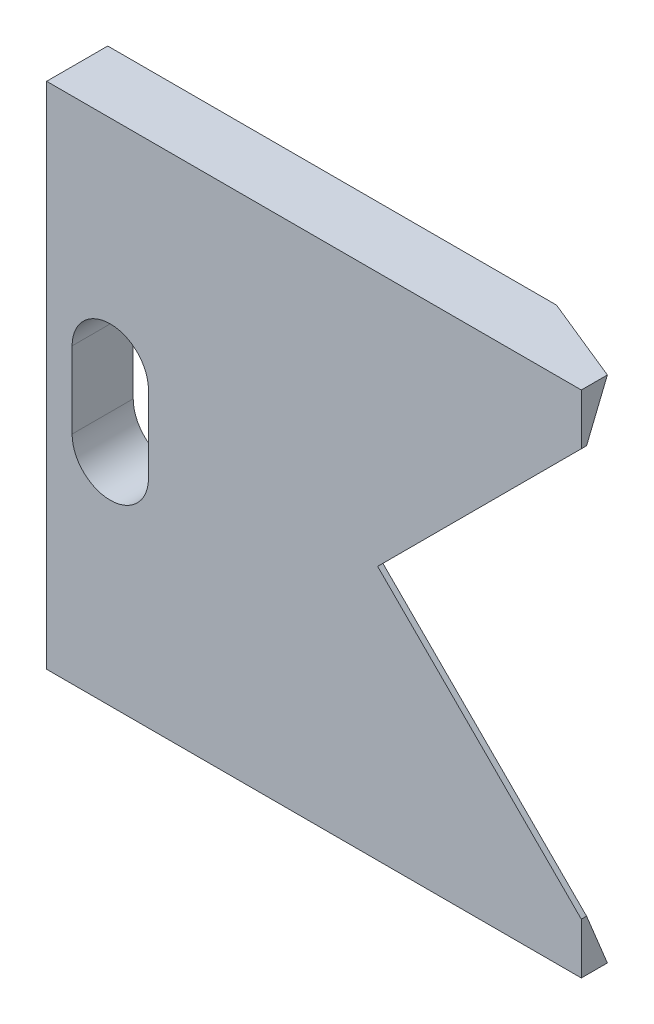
ISO-10303-21;
HEADER;
FILE_DESCRIPTION(('STEP AP214'),'2;1');
FILE_NAME('part.step','',(''),(''),'','','');
FILE_SCHEMA(('AUTOMOTIVE_DESIGN { 1 0 10303 214 1 1 1 1 }'));
ENDSEC;
DATA;
#1=APPLICATION_CONTEXT('core data for automotive mechanical design processes');
#2=APPLICATION_PROTOCOL_DEFINITION('international standard','automotive_design',2000,#1);
#3=PRODUCT_CONTEXT('',#1,'mechanical');
#4=PRODUCT('Part','Part','',(#3));
#5=PRODUCT_RELATED_PRODUCT_CATEGORY('part','',(#4));
#6=PRODUCT_DEFINITION_FORMATION('','',#4);
#7=PRODUCT_DEFINITION_CONTEXT('part definition',#1,'design');
#8=PRODUCT_DEFINITION('design','',#6,#7);
#9=PRODUCT_DEFINITION_SHAPE('','',#8);
#10=(LENGTH_UNIT() NAMED_UNIT(*) SI_UNIT(.MILLI.,.METRE.));
#11=(NAMED_UNIT(*) PLANE_ANGLE_UNIT() SI_UNIT($,.RADIAN.));
#12=(NAMED_UNIT(*) SI_UNIT($,.STERADIAN.) SOLID_ANGLE_UNIT());
#13=UNCERTAINTY_MEASURE_WITH_UNIT(LENGTH_MEASURE(1.E-05),#10,'distance_accuracy_value','');
#14=(GEOMETRIC_REPRESENTATION_CONTEXT(3) GLOBAL_UNCERTAINTY_ASSIGNED_CONTEXT((#13)) GLOBAL_UNIT_ASSIGNED_CONTEXT((#10,
#11,#12)) REPRESENTATION_CONTEXT('',''));
#15=CARTESIAN_POINT('',(0.,0.,0.));
#16=DIRECTION('',(0.,0.,1.));
#17=DIRECTION('',(1.,0.,0.));
#18=AXIS2_PLACEMENT_3D('',#15,#16,#17);
#19=CARTESIAN_POINT('',(0.,9.99999999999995,2.4));
#20=DIRECTION('',(0.,0.,1.));
#21=DIRECTION('',(1.,0.,0.));
#22=AXIS2_PLACEMENT_3D('',#19,#20,#21);
#23=PLANE('',#22);
#24=DIRECTION('',(0.,-1.,0.));
#25=VECTOR('',#24,1.);
#26=CARTESIAN_POINT('',(21.,8.00000000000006,2.4));
#27=LINE('',#26,#25);
#28=CARTESIAN_POINT('',(21.,9.99999999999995,2.4));
#29=VERTEX_POINT('',#28);
#30=CARTESIAN_POINT('',(21.,8.00000000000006,2.4));
#31=VERTEX_POINT('',#30);
#32=EDGE_CURVE('E122',#29,#31,#27,.T.);
#33=ORIENTED_EDGE('',*,*,#32,.F.);
#34=DIRECTION('',(-1.,0.,0.));
#35=VECTOR('',#34,1.);
#36=CARTESIAN_POINT('',(0.,9.99999999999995,2.4));
#37=LINE('',#36,#35);
#38=CARTESIAN_POINT('',(0.,9.99999999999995,2.4));
#39=VERTEX_POINT('',#38);
#40=EDGE_CURVE('E130',#29,#39,#37,.T.);
#41=ORIENTED_EDGE('',*,*,#40,.T.);
#42=DIRECTION('',(0.,-1.,0.));
#43=VECTOR('',#42,1.);
#44=CARTESIAN_POINT('',(0.,-9.99999999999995,2.4));
#45=LINE('',#44,#43);
#46=CARTESIAN_POINT('',(0.,-9.99999999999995,2.4));
#47=VERTEX_POINT('',#46);
#48=EDGE_CURVE('E138',#39,#47,#45,.T.);
#49=ORIENTED_EDGE('',*,*,#48,.T.);
#50=DIRECTION('',(1.,0.,0.));
#51=VECTOR('',#50,1.);
#52=CARTESIAN_POINT('',(0.,-9.99999999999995,2.4));
#53=LINE('',#52,#51);
#54=CARTESIAN_POINT('',(21.,-9.99999999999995,2.4));
#55=VERTEX_POINT('',#54);
#56=EDGE_CURVE('E141',#47,#55,#53,.T.);
#57=ORIENTED_EDGE('',*,*,#56,.T.);
#58=DIRECTION('',(0.,-1.,0.));
#59=VECTOR('',#58,1.);
#60=CARTESIAN_POINT('',(21.,-9.99999999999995,2.4));
#61=LINE('',#60,#59);
#62=CARTESIAN_POINT('',(21.,-8.00000000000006,2.4));
#63=VERTEX_POINT('',#62);
#64=EDGE_CURVE('E184',#63,#55,#61,.T.);
#65=ORIENTED_EDGE('',*,*,#64,.F.);
#66=DIRECTION('',(-0.707106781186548,0.707106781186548,0.));
#67=VECTOR('',#66,1.);
#68=CARTESIAN_POINT('',(22.9999999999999,-9.99999999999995,2.4));
#69=LINE('',#68,#67);
#70=CARTESIAN_POINT('',(12.9999999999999,0.,2.4));
#71=VERTEX_POINT('',#70);
#72=EDGE_CURVE('E150',#63,#71,#69,.T.);
#73=ORIENTED_EDGE('',*,*,#72,.T.);
#74=DIRECTION('',(0.707106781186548,0.707106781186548,0.));
#75=VECTOR('',#74,1.);
#76=CARTESIAN_POINT('',(22.9999999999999,9.99999999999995,2.4));
#77=LINE('',#76,#75);
#78=EDGE_CURVE('E133',#71,#31,#77,.T.);
#79=ORIENTED_EDGE('',*,*,#78,.T.);
#80=EDGE_LOOP('',(#33,#41,#49,#57,#65,#73,#79));
#81=FACE_BOUND('',#80,.T.);
#82=DIRECTION('',(0.,1.,0.));
#83=VECTOR('',#82,1.);
#84=CARTESIAN_POINT('',(4.,1.5,2.4));
#85=LINE('',#84,#83);
#86=CARTESIAN_POINT('',(4.,-1.5,2.4));
#87=VERTEX_POINT('',#86);
#88=CARTESIAN_POINT('',(4.,1.5,2.4));
#89=VERTEX_POINT('',#88);
#90=EDGE_CURVE('E216',#87,#89,#85,.T.);
#91=ORIENTED_EDGE('',*,*,#90,.F.);
#92=CARTESIAN_POINT('',(2.5,-1.5,2.4));
#93=DIRECTION('',(0.,0.,1.));
#94=DIRECTION('',(1.,0.,0.));
#95=AXIS2_PLACEMENT_3D('',#92,#93,#94);
#96=CIRCLE('',#95,1.5);
#97=CARTESIAN_POINT('',(1.,-1.5,2.4));
#98=VERTEX_POINT('',#97);
#99=EDGE_CURVE('E214',#98,#87,#96,.T.);
#100=ORIENTED_EDGE('',*,*,#99,.F.);
#101=DIRECTION('',(0.,-1.,0.));
#102=VECTOR('',#101,1.);
#103=CARTESIAN_POINT('',(1.,1.5,2.4));
#104=LINE('',#103,#102);
#105=CARTESIAN_POINT('',(1.,1.5,2.4));
#106=VERTEX_POINT('',#105);
#107=EDGE_CURVE('E221',#106,#98,#104,.T.);
#108=ORIENTED_EDGE('',*,*,#107,.F.);
#109=CARTESIAN_POINT('',(2.5,1.5,2.4));
#110=DIRECTION('',(0.,0.,1.));
#111=DIRECTION('',(1.,0.,0.));
#112=AXIS2_PLACEMENT_3D('',#109,#110,#111);
#113=CIRCLE('',#112,1.5);
#114=EDGE_CURVE('E218',#89,#106,#113,.T.);
#115=ORIENTED_EDGE('',*,*,#114,.F.);
#116=EDGE_LOOP('',(#91,#100,#108,#115));
#117=FACE_BOUND('',#116,.T.);
#118=ADVANCED_FACE('F29',(#81,#117),#23,.T.);
#119=CARTESIAN_POINT('',(0.,9.99999999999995,0.));
#120=DIRECTION('',(0.,0.,1.));
#121=DIRECTION('',(1.,0.,0.));
#122=AXIS2_PLACEMENT_3D('',#119,#120,#121);
#123=PLANE('',#122);
#124=DIRECTION('',(-1.,0.,0.));
#125=VECTOR('',#124,1.);
#126=CARTESIAN_POINT('',(0.,9.99999999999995,0.));
#127=LINE('',#126,#125);
#128=CARTESIAN_POINT('',(17.6259884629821,9.99999999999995,0.));
#129=VERTEX_POINT('',#128);
#130=CARTESIAN_POINT('',(0.,9.99999999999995,0.));
#131=VERTEX_POINT('',#130);
#132=EDGE_CURVE('E233',#129,#131,#127,.T.);
#133=ORIENTED_EDGE('',*,*,#132,.F.);
#134=DIRECTION('',(-0.707106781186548,-0.707106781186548,0.));
#135=VECTOR('',#134,1.);
#136=CARTESIAN_POINT('',(8.81299423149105,1.1870057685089,0.));
#137=LINE('',#136,#135);
#138=CARTESIAN_POINT('',(7.62598846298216,0.,0.));
#139=VERTEX_POINT('',#138);
#140=EDGE_CURVE('E167',#129,#139,#137,.T.);
#141=ORIENTED_EDGE('',*,*,#140,.T.);
#142=DIRECTION('',(0.707106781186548,-0.707106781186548,0.));
#143=VECTOR('',#142,1.);
#144=CARTESIAN_POINT('',(-1.1870057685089,8.81299423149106,0.));
#145=LINE('',#144,#143);
#146=CARTESIAN_POINT('',(17.6259884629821,-9.99999999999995,0.));
#147=VERTEX_POINT('',#146);
#148=EDGE_CURVE('E165',#139,#147,#145,.T.);
#149=ORIENTED_EDGE('',*,*,#148,.T.);
#150=DIRECTION('',(1.,0.,0.));
#151=VECTOR('',#150,1.);
#152=CARTESIAN_POINT('',(0.,-9.99999999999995,0.));
#153=LINE('',#152,#151);
#154=CARTESIAN_POINT('',(0.,-9.99999999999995,0.));
#155=VERTEX_POINT('',#154);
#156=EDGE_CURVE('E139',#155,#147,#153,.T.);
#157=ORIENTED_EDGE('',*,*,#156,.F.);
#158=DIRECTION('',(0.,-1.,0.));
#159=VECTOR('',#158,1.);
#160=CARTESIAN_POINT('',(0.,-9.99999999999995,0.));
#161=LINE('',#160,#159);
#162=EDGE_CURVE('E144',#131,#155,#161,.T.);
#163=ORIENTED_EDGE('',*,*,#162,.F.);
#164=EDGE_LOOP('',(#133,#141,#149,#157,#163));
#165=FACE_BOUND('',#164,.T.);
#166=CARTESIAN_POINT('',(2.5,-1.5,0.));
#167=DIRECTION('',(0.,0.,1.));
#168=DIRECTION('',(1.,0.,0.));
#169=AXIS2_PLACEMENT_3D('',#166,#167,#168);
#170=CIRCLE('',#169,1.5);
#171=CARTESIAN_POINT('',(1.,-1.5,0.));
#172=VERTEX_POINT('',#171);
#173=CARTESIAN_POINT('',(4.,-1.5,0.));
#174=VERTEX_POINT('',#173);
#175=EDGE_CURVE('E194',#172,#174,#170,.T.);
#176=ORIENTED_EDGE('',*,*,#175,.T.);
#177=DIRECTION('',(0.,1.,0.));
#178=VECTOR('',#177,1.);
#179=CARTESIAN_POINT('',(4.,1.5,0.));
#180=LINE('',#179,#178);
#181=CARTESIAN_POINT('',(4.,1.5,0.));
#182=VERTEX_POINT('',#181);
#183=EDGE_CURVE('E205',#174,#182,#180,.T.);
#184=ORIENTED_EDGE('',*,*,#183,.T.);
#185=CARTESIAN_POINT('',(2.5,1.5,0.));
#186=DIRECTION('',(0.,0.,1.));
#187=DIRECTION('',(1.,0.,0.));
#188=AXIS2_PLACEMENT_3D('',#185,#186,#187);
#189=CIRCLE('',#188,1.5);
#190=CARTESIAN_POINT('',(1.,1.5,0.));
#191=VERTEX_POINT('',#190);
#192=EDGE_CURVE('E208',#182,#191,#189,.T.);
#193=ORIENTED_EDGE('',*,*,#192,.T.);
#194=DIRECTION('',(0.,-1.,0.));
#195=VECTOR('',#194,1.);
#196=CARTESIAN_POINT('',(1.,1.5,0.));
#197=LINE('',#196,#195);
#198=EDGE_CURVE('E211',#191,#172,#197,.T.);
#199=ORIENTED_EDGE('',*,*,#198,.T.);
#200=EDGE_LOOP('',(#176,#184,#193,#199));
#201=FACE_BOUND('',#200,.T.);
#202=ADVANCED_FACE('F244',(#165,#201),#123,.F.);
#203=CARTESIAN_POINT('',(0.,9.99999999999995,2.4));
#204=DIRECTION('',(0.,-1.,0.));
#205=DIRECTION('',(0.,0.,-1.));
#206=AXIS2_PLACEMENT_3D('',#203,#204,#205);
#207=PLANE('',#206);
#208=ORIENTED_EDGE('',*,*,#40,.F.);
#209=DIRECTION('',(0.,0.,1.));
#210=VECTOR('',#209,1.);
#211=CARTESIAN_POINT('',(21.,9.99999999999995,0.));
#212=LINE('',#211,#210);
#213=CARTESIAN_POINT('',(21.,9.99999999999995,1.37743444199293));
#214=VERTEX_POINT('',#213);
#215=EDGE_CURVE('E119',#214,#29,#212,.T.);
#216=ORIENTED_EDGE('',*,*,#215,.F.);
#217=DIRECTION('',(0.92582009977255,0.,0.377964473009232));
#218=VECTOR('',#217,1.);
#219=CARTESIAN_POINT('',(22.9999999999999,9.99999999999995,2.19393102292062));
#220=LINE('',#219,#218);
#221=EDGE_CURVE('E163',#214,#129,#220,.F.);
#222=ORIENTED_EDGE('',*,*,#221,.T.);
#223=ORIENTED_EDGE('',*,*,#132,.T.);
#224=DIRECTION('',(0.,0.,-1.));
#225=VECTOR('',#224,1.);
#226=CARTESIAN_POINT('',(0.,9.99999999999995,2.4));
#227=LINE('',#226,#225);
#228=EDGE_CURVE('E137',#39,#131,#227,.T.);
#229=ORIENTED_EDGE('',*,*,#228,.F.);
#230=EDGE_LOOP('',(#208,#216,#222,#223,#229));
#231=FACE_BOUND('',#230,.T.);
#232=ADVANCED_FACE('F31',(#231),#207,.F.);
#233=CARTESIAN_POINT('',(0.,-9.99999999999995,2.4));
#234=DIRECTION('',(1.,0.,0.));
#235=DIRECTION('',(0.,0.,-1.));
#236=AXIS2_PLACEMENT_3D('',#233,#234,#235);
#237=PLANE('',#236);
#238=ORIENTED_EDGE('',*,*,#162,.T.);
#239=DIRECTION('',(0.,0.,-1.));
#240=VECTOR('',#239,1.);
#241=CARTESIAN_POINT('',(0.,-9.99999999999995,2.4));
#242=LINE('',#241,#240);
#243=EDGE_CURVE('E156',#47,#155,#242,.T.);
#244=ORIENTED_EDGE('',*,*,#243,.F.);
#245=ORIENTED_EDGE('',*,*,#48,.F.);
#246=ORIENTED_EDGE('',*,*,#228,.T.);
#247=EDGE_LOOP('',(#238,#244,#245,#246));
#248=FACE_BOUND('',#247,.T.);
#249=ADVANCED_FACE('F237',(#248),#237,.F.);
#250=CARTESIAN_POINT('',(0.,-9.99999999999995,2.4));
#251=DIRECTION('',(0.,1.,0.));
#252=DIRECTION('',(0.,0.,1.));
#253=AXIS2_PLACEMENT_3D('',#250,#251,#252);
#254=PLANE('',#253);
#255=DIRECTION('',(-0.925820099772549,0.,-0.377964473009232));
#256=VECTOR('',#255,1.);
#257=CARTESIAN_POINT('',(22.9999999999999,-9.99999999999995,2.19393102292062));
#258=LINE('',#257,#256);
#259=CARTESIAN_POINT('',(21.,-9.99999999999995,1.37743444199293));
#260=VERTEX_POINT('',#259);
#261=EDGE_CURVE('E171',#147,#260,#258,.F.);
#262=ORIENTED_EDGE('',*,*,#261,.T.);
#263=DIRECTION('',(0.,0.,1.));
#264=VECTOR('',#263,1.);
#265=CARTESIAN_POINT('',(21.,-9.99999999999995,0.));
#266=LINE('',#265,#264);
#267=EDGE_CURVE('E51',#260,#55,#266,.T.);
#268=ORIENTED_EDGE('',*,*,#267,.T.);
#269=ORIENTED_EDGE('',*,*,#56,.F.);
#270=ORIENTED_EDGE('',*,*,#243,.T.);
#271=ORIENTED_EDGE('',*,*,#156,.T.);
#272=EDGE_LOOP('',(#262,#268,#269,#270,#271));
#273=FACE_BOUND('',#272,.T.);
#274=ADVANCED_FACE('F243',(#273),#254,.F.);
#275=CARTESIAN_POINT('',(22.9999999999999,-9.99999999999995,2.4));
#276=DIRECTION('',(-0.707106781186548,-0.707106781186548,0.));
#277=DIRECTION('',(0.707106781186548,-0.707106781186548,0.));
#278=AXIS2_PLACEMENT_3D('',#275,#276,#277);
#279=PLANE('',#278);
#280=ORIENTED_EDGE('',*,*,#72,.F.);
#281=DIRECTION('',(0.,0.,1.));
#282=VECTOR('',#281,1.);
#283=CARTESIAN_POINT('',(21.,-8.00000000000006,0.));
#284=LINE('',#283,#282);
#285=CARTESIAN_POINT('',(21.,-8.00000000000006,2.19393102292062));
#286=VERTEX_POINT('',#285);
#287=EDGE_CURVE('E175',#286,#63,#284,.T.);
#288=ORIENTED_EDGE('',*,*,#287,.F.);
#289=DIRECTION('',(-0.707106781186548,0.707106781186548,0.));
#290=VECTOR('',#289,1.);
#291=CARTESIAN_POINT('',(22.9999999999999,-9.99999999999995,2.19393102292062));
#292=LINE('',#291,#290);
#293=CARTESIAN_POINT('',(12.9999999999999,0.,2.19393102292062));
#294=VERTEX_POINT('',#293);
#295=EDGE_CURVE('E169',#286,#294,#292,.T.);
#296=ORIENTED_EDGE('',*,*,#295,.T.);
#297=DIRECTION('',(0.,0.,-1.));
#298=VECTOR('',#297,1.);
#299=CARTESIAN_POINT('',(12.9999999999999,0.,2.4));
#300=LINE('',#299,#298);
#301=EDGE_CURVE('E153',#71,#294,#300,.T.);
#302=ORIENTED_EDGE('',*,*,#301,.F.);
#303=EDGE_LOOP('',(#280,#288,#296,#302));
#304=FACE_BOUND('',#303,.T.);
#305=ADVANCED_FACE('F182',(#304),#279,.F.);
#306=CARTESIAN_POINT('',(22.9999999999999,9.99999999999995,2.4));
#307=DIRECTION('',(-0.707106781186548,0.707106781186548,0.));
#308=DIRECTION('',(-0.707106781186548,-0.707106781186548,0.));
#309=AXIS2_PLACEMENT_3D('',#306,#307,#308);
#310=PLANE('',#309);
#311=DIRECTION('',(0.707106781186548,0.707106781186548,0.));
#312=VECTOR('',#311,1.);
#313=CARTESIAN_POINT('',(22.9999999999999,9.99999999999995,2.19393102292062));
#314=LINE('',#313,#312);
#315=CARTESIAN_POINT('',(21.,8.00000000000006,2.19393102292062));
#316=VERTEX_POINT('',#315);
#317=EDGE_CURVE('E160',#294,#316,#314,.T.);
#318=ORIENTED_EDGE('',*,*,#317,.T.);
#319=DIRECTION('',(0.,0.,1.));
#320=VECTOR('',#319,1.);
#321=CARTESIAN_POINT('',(21.,8.00000000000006,0.));
#322=LINE('',#321,#320);
#323=EDGE_CURVE('E43',#316,#31,#322,.T.);
#324=ORIENTED_EDGE('',*,*,#323,.T.);
#325=ORIENTED_EDGE('',*,*,#78,.F.);
#326=ORIENTED_EDGE('',*,*,#301,.T.);
#327=EDGE_LOOP('',(#318,#324,#325,#326));
#328=FACE_BOUND('',#327,.T.);
#329=ADVANCED_FACE('F198',(#328),#310,.F.);
#330=CARTESIAN_POINT('',(2.5,-1.5,2.4));
#331=DIRECTION('',(0.,0.,-1.));
#332=DIRECTION('',(-1.,0.,0.));
#333=AXIS2_PLACEMENT_3D('',#330,#331,#332);
#334=CYLINDRICAL_SURFACE('',#333,1.5);
#335=ORIENTED_EDGE('',*,*,#175,.F.);
#336=DIRECTION('',(0.,0.,-1.));
#337=VECTOR('',#336,1.);
#338=CARTESIAN_POINT('',(1.,-1.5,2.4));
#339=LINE('',#338,#337);
#340=EDGE_CURVE('E223',#98,#172,#339,.T.);
#341=ORIENTED_EDGE('',*,*,#340,.F.);
#342=ORIENTED_EDGE('',*,*,#99,.T.);
#343=DIRECTION('',(0.,0.,-1.));
#344=VECTOR('',#343,1.);
#345=CARTESIAN_POINT('',(4.,-1.5,2.4));
#346=LINE('',#345,#344);
#347=EDGE_CURVE('E230',#87,#174,#346,.T.);
#348=ORIENTED_EDGE('',*,*,#347,.T.);
#349=EDGE_LOOP('',(#335,#341,#342,#348));
#350=FACE_BOUND('',#349,.T.);
#351=ADVANCED_FACE('F251',(#350),#334,.F.);
#352=CARTESIAN_POINT('',(4.,1.5,2.4));
#353=DIRECTION('',(-1.,0.,0.));
#354=DIRECTION('',(0.,-1.,0.));
#355=AXIS2_PLACEMENT_3D('',#352,#353,#354);
#356=PLANE('',#355);
#357=ORIENTED_EDGE('',*,*,#183,.F.);
#358=ORIENTED_EDGE('',*,*,#347,.F.);
#359=ORIENTED_EDGE('',*,*,#90,.T.);
#360=DIRECTION('',(0.,0.,-1.));
#361=VECTOR('',#360,1.);
#362=CARTESIAN_POINT('',(4.,1.5,2.4));
#363=LINE('',#362,#361);
#364=EDGE_CURVE('E228',#89,#182,#363,.T.);
#365=ORIENTED_EDGE('',*,*,#364,.T.);
#366=EDGE_LOOP('',(#357,#358,#359,#365));
#367=FACE_BOUND('',#366,.T.);
#368=ADVANCED_FACE('F260',(#367),#356,.T.);
#369=CARTESIAN_POINT('',(2.5,1.5,2.4));
#370=DIRECTION('',(0.,0.,-1.));
#371=DIRECTION('',(-1.,0.,0.));
#372=AXIS2_PLACEMENT_3D('',#369,#370,#371);
#373=CYLINDRICAL_SURFACE('',#372,1.5);
#374=ORIENTED_EDGE('',*,*,#192,.F.);
#375=ORIENTED_EDGE('',*,*,#364,.F.);
#376=ORIENTED_EDGE('',*,*,#114,.T.);
#377=DIRECTION('',(0.,0.,-1.));
#378=VECTOR('',#377,1.);
#379=CARTESIAN_POINT('',(1.,1.5,2.4));
#380=LINE('',#379,#378);
#381=EDGE_CURVE('E226',#106,#191,#380,.T.);
#382=ORIENTED_EDGE('',*,*,#381,.T.);
#383=EDGE_LOOP('',(#374,#375,#376,#382));
#384=FACE_BOUND('',#383,.T.);
#385=ADVANCED_FACE('F264',(#384),#373,.F.);
#386=CARTESIAN_POINT('',(1.,1.5,2.4));
#387=DIRECTION('',(1.,0.,0.));
#388=DIRECTION('',(0.,1.,0.));
#389=AXIS2_PLACEMENT_3D('',#386,#387,#388);
#390=PLANE('',#389);
#391=ORIENTED_EDGE('',*,*,#198,.F.);
#392=ORIENTED_EDGE('',*,*,#381,.F.);
#393=ORIENTED_EDGE('',*,*,#107,.T.);
#394=ORIENTED_EDGE('',*,*,#340,.T.);
#395=EDGE_LOOP('',(#391,#392,#393,#394));
#396=FACE_BOUND('',#395,.T.);
#397=ADVANCED_FACE('F255',(#396),#390,.T.);
#398=CARTESIAN_POINT('',(22.9999999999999,-9.99999999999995,2.19393102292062));
#399=DIRECTION('',(-0.353553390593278,-0.353553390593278,0.866025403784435));
#400=DIRECTION('',(0.925820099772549,0.,0.377964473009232));
#401=AXIS2_PLACEMENT_3D('',#398,#399,#400);
#402=PLANE('',#401);
#403=DIRECTION('',(0.,-0.925820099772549,-0.377964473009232));
#404=VECTOR('',#403,1.);
#405=CARTESIAN_POINT('',(21.,-9.71428571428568,1.49407681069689));
#406=LINE('',#405,#404);
#407=EDGE_CURVE('E37',#260,#286,#406,.F.);
#408=ORIENTED_EDGE('',*,*,#407,.F.);
#409=ORIENTED_EDGE('',*,*,#261,.F.);
#410=ORIENTED_EDGE('',*,*,#148,.F.);
#411=DIRECTION('',(0.925820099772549,0.,0.377964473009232));
#412=VECTOR('',#411,1.);
#413=CARTESIAN_POINT('',(21.5714285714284,0.,5.69320208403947));
#414=LINE('',#413,#412);
#415=EDGE_CURVE('E190',#294,#139,#414,.F.);
#416=ORIENTED_EDGE('',*,*,#415,.F.);
#417=ORIENTED_EDGE('',*,*,#295,.F.);
#418=EDGE_LOOP('',(#408,#409,#410,#416,#417));
#419=FACE_BOUND('',#418,.T.);
#420=ADVANCED_FACE('F187',(#419),#402,.F.);
#421=CARTESIAN_POINT('',(22.9999999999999,9.99999999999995,2.19393102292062));
#422=DIRECTION('',(-0.353553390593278,0.353553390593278,0.866025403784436));
#423=DIRECTION('',(0.92582009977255,0.,0.377964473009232));
#424=AXIS2_PLACEMENT_3D('',#421,#422,#423);
#425=PLANE('',#424);
#426=DIRECTION('',(0.,-0.92582009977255,0.377964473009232));
#427=VECTOR('',#426,1.);
#428=CARTESIAN_POINT('',(21.,9.71428571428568,1.49407681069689));
#429=LINE('',#428,#427);
#430=EDGE_CURVE('E11',#316,#214,#429,.F.);
#431=ORIENTED_EDGE('',*,*,#430,.F.);
#432=ORIENTED_EDGE('',*,*,#317,.F.);
#433=ORIENTED_EDGE('',*,*,#415,.T.);
#434=ORIENTED_EDGE('',*,*,#140,.F.);
#435=ORIENTED_EDGE('',*,*,#221,.F.);
#436=EDGE_LOOP('',(#431,#432,#433,#434,#435));
#437=FACE_BOUND('',#436,.T.);
#438=ADVANCED_FACE('F196',(#437),#425,.F.);
#439=CARTESIAN_POINT('',(21.,-9.99999999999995,0.));
#440=DIRECTION('',(-1.,0.,0.));
#441=DIRECTION('',(0.,0.,1.));
#442=AXIS2_PLACEMENT_3D('',#439,#440,#441);
#443=PLANE('',#442);
#444=ORIENTED_EDGE('',*,*,#407,.T.);
#445=ORIENTED_EDGE('',*,*,#287,.T.);
#446=ORIENTED_EDGE('',*,*,#64,.T.);
#447=ORIENTED_EDGE('',*,*,#267,.F.);
#448=EDGE_LOOP('',(#444,#445,#446,#447));
#449=FACE_BOUND('',#448,.T.);
#450=ADVANCED_FACE('F174',(#449),#443,.F.);
#451=CARTESIAN_POINT('',(21.,8.00000000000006,0.));
#452=DIRECTION('',(-1.,0.,0.));
#453=DIRECTION('',(0.,0.,1.));
#454=AXIS2_PLACEMENT_3D('',#451,#452,#453);
#455=PLANE('',#454);
#456=ORIENTED_EDGE('',*,*,#430,.T.);
#457=ORIENTED_EDGE('',*,*,#215,.T.);
#458=ORIENTED_EDGE('',*,*,#32,.T.);
#459=ORIENTED_EDGE('',*,*,#323,.F.);
#460=EDGE_LOOP('',(#456,#457,#458,#459));
#461=FACE_BOUND('',#460,.T.);
#462=ADVANCED_FACE('F121',(#461),#455,.F.);
#463=CLOSED_SHELL('',(#118,#202,#232,#249,#274,#305,#329,#351,#368,#385,#397,#420,#438,#450,#462));
#464=MANIFOLD_SOLID_BREP('B2',#463);
#465=ADVANCED_BREP_SHAPE_REPRESENTATION('',(#18,#464),#14);
#466=SHAPE_DEFINITION_REPRESENTATION(#9,#465);
ENDSEC;
END-ISO-10303-21;
